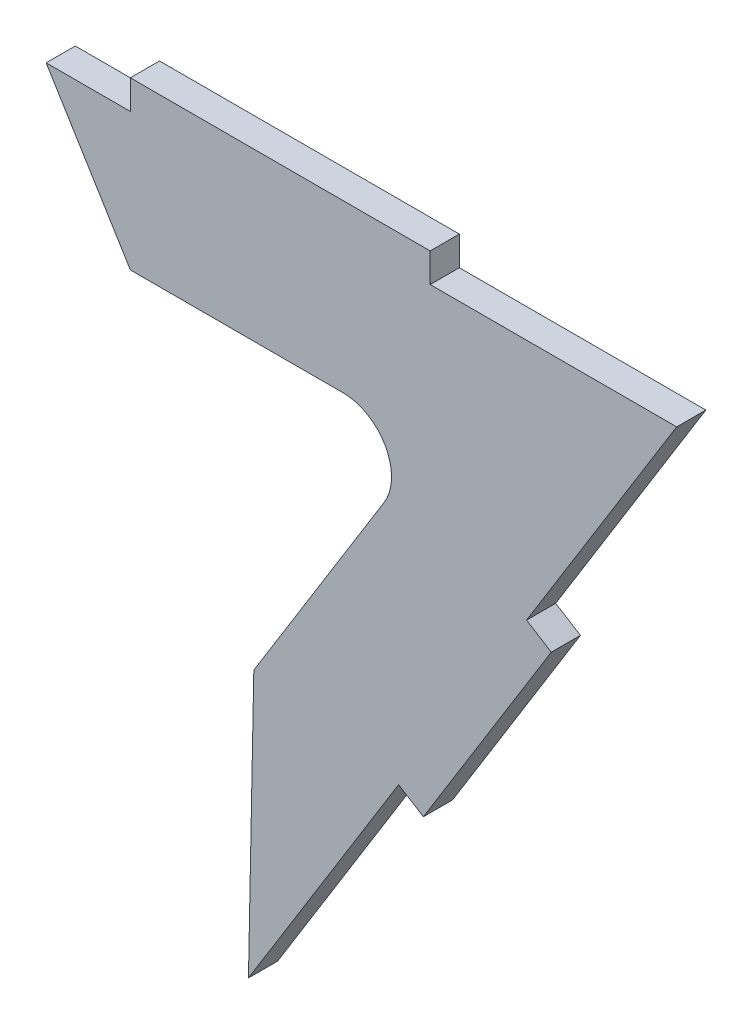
from build123d import *

# Parameters (mm, degrees)
BOSS_EXTRUDE1_DEPTH = 1.524


with BuildPart() as part:
    # Sketch1 → Boss-Extrude1 (new body)
    with BuildSketch(Plane.XY):
        with BuildLine():
            Line((44.649794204, 0), (44.649794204, 1.524))
            Line((44.649794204, 1.524), (60.326696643, 1.524))
            Line((60.326696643, 1.524), (60.326696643, 0))
            Line((60.326696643, 0), (73.214920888, 0))
            Line((73.214920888, 0), (65.363217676, -12.676228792))
            Line((65.363217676, -12.676228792), (66.65881524, -13.478726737))
            Line((66.65881524, -13.478726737), (59.971332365, -24.275373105))
            Line((59.971332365, -24.275373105), (58.675734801, -23.47287516))
            Line((58.675734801, -23.47287516), (50.824031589, -36.149103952))
            Line((50.824031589, -36.149103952), (51.105257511, -22.065808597))
            Line((51.105257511, -22.065808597), (57.924960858, -11.055698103))
            ThreePointArc((57.924960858, -11.055698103), (57.984735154, -8.482410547), (55.765631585, -7.178201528))
            Line((55.765631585, -7.178201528), (44.649794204, -7.178201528))
            Line((44.649794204, -7.178201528), (40.247248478, 0))
            Line((40.247248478, 0), (44.649794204, 0))
        make_face()
    extrude(amount=BOSS_EXTRUDE1_DEPTH)


solid = part.part
